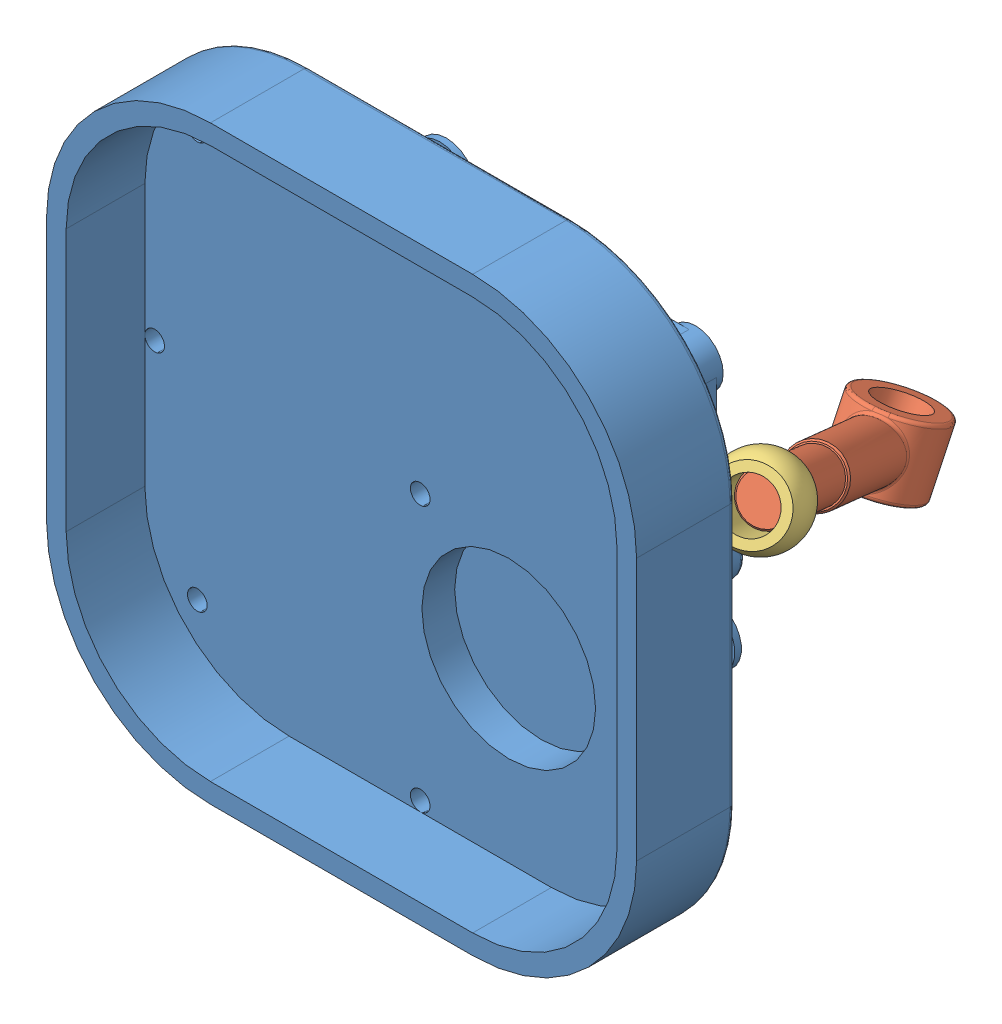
SolidWorks assembly PortePeage.SLDASM, configuration Défaut (file format 14000). Lengths in mm.
Overall size (504 516.69 479.44).
18 component instances, 12 part files, 8 mates.
Components (placement in the parent):
- Bati-1: Bati.SLDASM [Défaut] at (-200.9105 364.0904 312.4429) size (406 360 356)
  - Reducteur-1: Reducteur.SLDPRT [Défaut] at (-252.4721 -127.2379 27) size (360 360 174)
  - Bati-1: Bati.SLDPRT [Défaut] at (-293.4721 42.2621 7) x (0 -1 0) z (1 0 0) size (301 276 243)
  - Bague-1: Bague.SLDPRT [Défaut] at (-134.4721 -7.2379 -190) x (-1 0 0) z (0 0.924225 -0.381849) size (50 68.6 68.6)
  - Bague-2: Bague.SLDPRT [Défaut] at (-298.4721 -7.2379 -190) x (1 0 0) z (0 0.094472 0.995528) size (50 68.6 68.6)
  - Vis-1: Vis.SLDPRT [M8-1.25] at (-208.4721 -71.2379 -9) x (0.133526 0.991045 0) z (0 0 -1) size (27 27 38.26)
  - Vis-2: Vis.SLDPRT [M8-1.25] at (-72.4721 52.7621 -9) x (0.375037 -0.92701 0) z (0 0 -1) size (27 27 38.26)
  - Vis-3: Vis.SLDPRT [M8-1.25] at (-208.4721 176.7621 -9) x (0.607105 -0.794622 0) z (0 0 -1) size (27 27 38.26)
- Croisillon-1: Croisillon.SLDPRT [Défaut] at (-185.7296 393.5059 198.8946) x (0.936841 -0.151205 -0.315384) z (0.349757 0.40501 0.84477) size (50 40 175.5)
- Plateau-1: Plateau.SLDASM [Défaut] at (-137.6699 446.7446 322.9832) x (0.666994 0.745063 0) z (-0.745063 0.666994 0) size (174.55 96 88.14)
  - Plateau-1: Plateau.SLDPRT [Défaut] at (-121.4772 3.5403 0.9236) size (174.55 96 88.14)
  - Loctite-1: Loctite.SLDPRT [Défaut] at (-36.6458 68.708 0.9236) x (-0.167203 -0.077968 -0.982835) z (0.890751 0.415364 -0.184488) size (59.2 20 59.2)
- Porte-1: Porte.SLDASM [Défaut] at (-426.4993 336.6187 132.1437) x (-1 0 0) z (0 -0.432315 -0.901723) size (420 268.69 253.92)
  - Arbrefourche-1: Arbrefourche.SLDPRT [Défaut] at (-93.1167 22.439 0) size (420 88 80)
  - Goupille-1: Goupille.SLDPRT [Défaut] at (-209.1167 66.439 0) x (-0.047297 0 -0.998881) z (0 -1 0) size (30 30 88)
  - Barre-1: Barre.SLDPRT [Défaut] at (97.8833 22.439 0) x (0 0.741413 -0.671049) z (-1 0 0) size (290 80 50)
  - Ecrou-1: Ecrou.SLDPRT [M8-1.25] at (122.8833 22.439 0) x (0 -0.171163 -0.985243) z (1 0 0) size (80 80 28.76)
- Rotule-1: Rotule.SLDPRT [Défaut] at (-162.8006 420.0572 254.2753) x (0.530033 0.657982 -0.534906) z (-0.772486 0.634843 0.015465) size (49 28 49)
Mates (geometry in assembly coordinates):
- Coaxiale6: concentric anti-aligned: cylinder of Bati-1/reducteur-1 through (-219.3826 356.8525 225.4429) axis (0 0 1) radius 18.5; cylinder of Plateau-1/plateau-1 through (-219.3826 356.8525 218.164) axis (0 0 -1) radius 18.5
- Coïncidente2: coincident anti-aligned: plane of Bati-1/reducteur-1 through (-219.3826 356.8525 319.4429) normal (0 0 -1); plane of Plateau-1/plateau-1 through (-241.8603 331.7438 319.4429) normal (0 0 1)
- Coaxiale7: concentric: sphere of Plateau-1/Loctite-1; sphere of Rotule-1
- Coaxiale8: concentric aligned: cylinder of Croisillon-1 through (-164.7442 417.8065 249.5808) axis (-0.349757 -0.40501 -0.84477) radius 14.6; cylinder of Rotule-1 through (-170.0412 411.6727 236.787) axis (-0.349757 -0.40501 -0.84477) radius 14.6
- Coaxiale10: concentric aligned: cylinder of Bati-1/Bague-1 through (-335.3826 356.8525 122.4429) axis (1 0 0) radius 25; cylinder of Porte-1/ArbreFourche-1 through (-499.3826 356.8525 122.4429) axis (1 0 0) radius 25
- Coïncidente3: coincident anti-aligned: plane of Bati-1/Bague-2 through (-499.3826 331.9643 124.8047) normal (-1 0 0); plane of Porte-1/Barre-1 through (-499.3826 356.8525 122.4429) normal (1 0 0)
- Coaxiale11: concentric aligned: cylinder of Croisillon-1 through (-217.3826 338.818 131.0892) axis (0 0.901723 -0.432315) radius 15; cylinder of Porte-1/Goupille-1 through (-217.3826 317.1767 141.4648) axis (0 0.901723 -0.432315) radius 15
- Coïncidente4: coincident anti-aligned: plane of Croisillon-1 through (-217.3826 338.818 131.0892) normal (0 -0.901723 0.432315); plane of Porte-1/ArbreFourche-1 through (-167.0685 357.8399 170.765) normal (0 0.901723 -0.432315)
